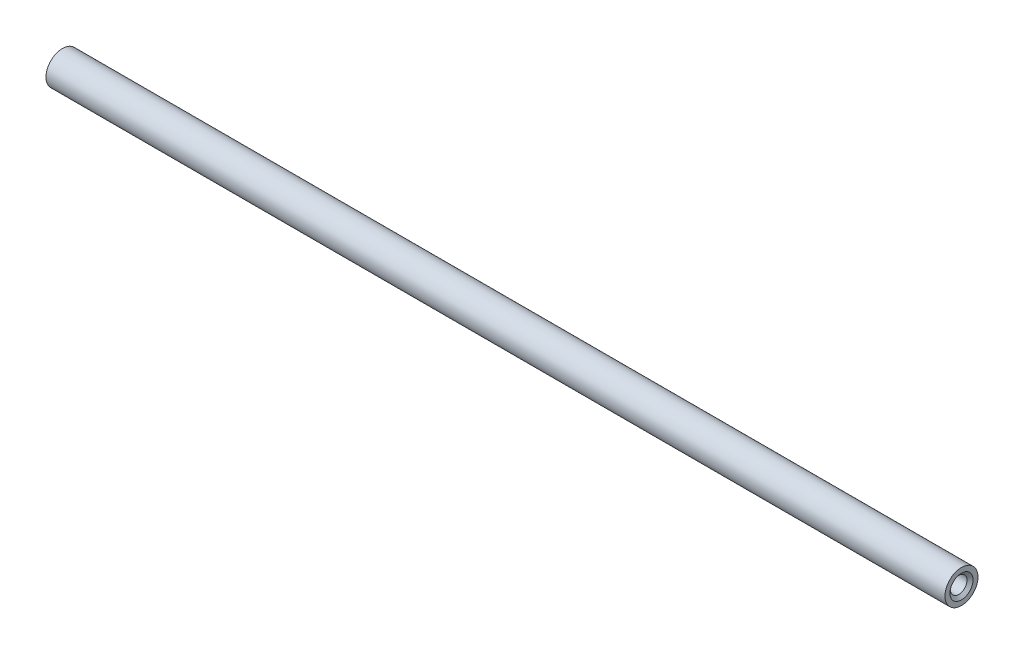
from build123d import *

# Parameters (mm, degrees)
SKETCH1_W                              = 172.72
SKETCH1_H                              = 3.175
F_1_8_0_125_DIAMETER_HOLE1_D           = 3.175
F_1_8_0_125_DIAMETER_HOLE1_DEPTH       = 19.05
F_1_8_0_125_DIAMETER_HOLE1_CSINK_D     = 4.445
F_1_8_0_125_DIAMETER_HOLE1_CSINK_ANGLE = 100
F_1_8_0_125_DIAMETER_HOLE1_TIP         = 0.953866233
F_1_8_0_125_DIAMETER_HOLE3_D           = 3.175
F_1_8_0_125_DIAMETER_HOLE3_DEPTH       = 19.05
F_1_8_0_125_DIAMETER_HOLE3_CSINK_D     = 4.445
F_1_8_0_125_DIAMETER_HOLE3_CSINK_ANGLE = 100
F_1_8_0_125_DIAMETER_HOLE3_TIP         = 0.953866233


with BuildPart() as part:
    # Sketch1 → Revolve3 (revolve)
    with BuildSketch(Plane(origin=(0, 0, 0), x_dir=(1, 0, 0), z_dir=(0, 1, 0)), mode=Mode.PRIVATE) as revolve3_sk:
        with Locations((-86.36, 1.5875)):
            Rectangle(SKETCH1_W, SKETCH1_H)
    revolve(revolve3_sk.sketch.rotate(Axis((0, 0, -3.175), (-1, 0, 0)), 180), axis=Axis((0, 0, -3.175), (-1, 0, 0)))

    # 1_8 _0.125_ Diameter Hole1
    with Locations(Plane.ZY.offset(172.72)):
        with Locations((-3.175, 0)):
            CounterSinkHole(F_1_8_0_125_DIAMETER_HOLE1_D / 2, F_1_8_0_125_DIAMETER_HOLE1_CSINK_D / 2, depth=F_1_8_0_125_DIAMETER_HOLE1_DEPTH, counter_sink_angle=F_1_8_0_125_DIAMETER_HOLE1_CSINK_ANGLE)
            with Locations((0, 0, -(F_1_8_0_125_DIAMETER_HOLE1_DEPTH + F_1_8_0_125_DIAMETER_HOLE1_TIP / 2))):  # 118° drill point
                Cone(0, F_1_8_0_125_DIAMETER_HOLE1_D / 2, F_1_8_0_125_DIAMETER_HOLE1_TIP, mode=Mode.SUBTRACT)

    # 1_8 _0.125_ Diameter Hole3
    with Locations(Plane(origin=(0, 0, 0), x_dir=(0, 0, -1), z_dir=(1, 0, 0))):
        with Locations((3.175, 0)):
            CounterSinkHole(F_1_8_0_125_DIAMETER_HOLE3_D / 2, F_1_8_0_125_DIAMETER_HOLE3_CSINK_D / 2, depth=F_1_8_0_125_DIAMETER_HOLE3_DEPTH, counter_sink_angle=F_1_8_0_125_DIAMETER_HOLE3_CSINK_ANGLE)
            with Locations((0, 0, -(F_1_8_0_125_DIAMETER_HOLE3_DEPTH + F_1_8_0_125_DIAMETER_HOLE3_TIP / 2))):  # 118° drill point
                Cone(0, F_1_8_0_125_DIAMETER_HOLE3_D / 2, F_1_8_0_125_DIAMETER_HOLE3_TIP, mode=Mode.SUBTRACT)


solid = part.part
